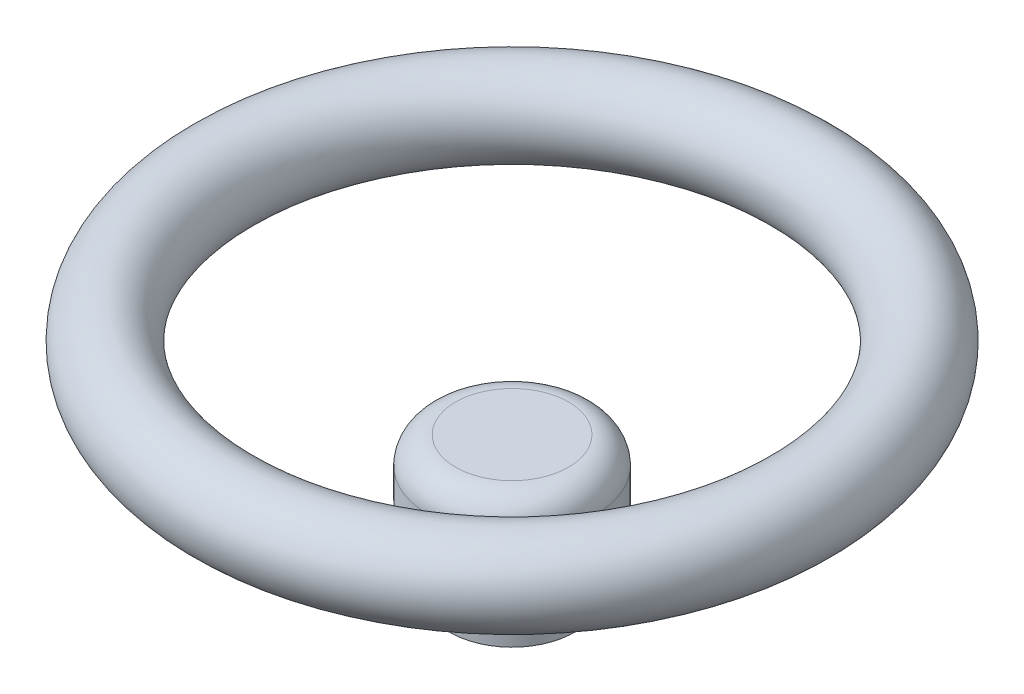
ISO-10303-21;
HEADER;
FILE_DESCRIPTION(('STEP AP214'),'2;1');
FILE_NAME('part.step','',(''),(''),'','','');
FILE_SCHEMA(('AUTOMOTIVE_DESIGN { 1 0 10303 214 1 1 1 1 }'));
ENDSEC;
DATA;
#1=APPLICATION_CONTEXT('core data for automotive mechanical design processes');
#2=APPLICATION_PROTOCOL_DEFINITION('international standard','automotive_design',2000,#1);
#3=PRODUCT_CONTEXT('',#1,'mechanical');
#4=PRODUCT('Part','Part','',(#3));
#5=PRODUCT_RELATED_PRODUCT_CATEGORY('part','',(#4));
#6=PRODUCT_DEFINITION_FORMATION('','',#4);
#7=PRODUCT_DEFINITION_CONTEXT('part definition',#1,'design');
#8=PRODUCT_DEFINITION('design','',#6,#7);
#9=PRODUCT_DEFINITION_SHAPE('','',#8);
#10=(LENGTH_UNIT() NAMED_UNIT(*) SI_UNIT(.MILLI.,.METRE.));
#11=(NAMED_UNIT(*) PLANE_ANGLE_UNIT() SI_UNIT($,.RADIAN.));
#12=(NAMED_UNIT(*) SI_UNIT($,.STERADIAN.) SOLID_ANGLE_UNIT());
#13=UNCERTAINTY_MEASURE_WITH_UNIT(LENGTH_MEASURE(1.E-05),#10,'distance_accuracy_value','');
#14=(GEOMETRIC_REPRESENTATION_CONTEXT(3) GLOBAL_UNCERTAINTY_ASSIGNED_CONTEXT((#13)) GLOBAL_UNIT_ASSIGNED_CONTEXT((#10,
#11,#12)) REPRESENTATION_CONTEXT('',''));
#15=CARTESIAN_POINT('',(0.,0.,0.));
#16=DIRECTION('',(0.,0.,1.));
#17=DIRECTION('',(1.,0.,0.));
#18=AXIS2_PLACEMENT_3D('',#15,#16,#17);
#19=CARTESIAN_POINT('',(0.,17.0750983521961,0.));
#20=DIRECTION('',(0.,1.,0.));
#21=DIRECTION('',(-1.,0.,0.));
#22=AXIS2_PLACEMENT_3D('',#19,#20,#21);
#23=TOROIDAL_SURFACE('',#22,60.4458481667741,8.73498068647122);
#24=CARTESIAN_POINT('',(-69.1808288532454,17.0750983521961,0.));
#25=VERTEX_POINT('',#24);
#26=VERTEX_LOOP('',#25);
#27=FACE_BOUND('',#26,.T.);
#28=ADVANCED_FACE('F36',(#27),#23,.T.);
#29=CLOSED_SHELL('',(#28));
#30=MANIFOLD_SOLID_BREP('B2',#29);
#31=CARTESIAN_POINT('',(0.,0.,0.));
#32=DIRECTION('',(0.,-1.,0.));
#33=DIRECTION('',(1.,0.,0.));
#34=AXIS2_PLACEMENT_3D('',#31,#32,#33);
#35=PLANE('',#34);
#36=CARTESIAN_POINT('',(0.,0.,0.));
#37=DIRECTION('',(0.,1.,0.));
#38=DIRECTION('',(-1.,0.,0.));
#39=AXIS2_PLACEMENT_3D('',#36,#37,#38);
#40=CIRCLE('',#39,11.8621252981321);
#41=CARTESIAN_POINT('',(-11.8621252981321,0.,0.));
#42=VERTEX_POINT('',#41);
#43=EDGE_CURVE('E35',#42,#42,#40,.T.);
#44=ORIENTED_EDGE('',*,*,#43,.T.);
#45=EDGE_LOOP('',(#44));
#46=FACE_BOUND('',#45,.T.);
#47=ADVANCED_FACE('F48',(#46),#35,.F.);
#48=CARTESIAN_POINT('',(0.,-5.72295049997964,0.));
#49=DIRECTION('',(0.,1.,0.));
#50=DIRECTION('',(-1.,0.,0.));
#51=AXIS2_PLACEMENT_3D('',#48,#49,#50);
#52=TOROIDAL_SURFACE('',#51,11.8621252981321,5.72295049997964);
#53=ORIENTED_EDGE('',*,*,#43,.F.);
#54=EDGE_LOOP('',(#53));
#55=FACE_BOUND('',#54,.T.);
#56=CARTESIAN_POINT('',(0.,-5.72295049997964,0.));
#57=DIRECTION('',(0.,1.,0.));
#58=DIRECTION('',(-1.,0.,0.));
#59=AXIS2_PLACEMENT_3D('',#56,#57,#58);
#60=CIRCLE('',#59,17.5850757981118);
#61=CARTESIAN_POINT('',(-17.5850757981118,-5.72295049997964,0.));
#62=VERTEX_POINT('',#61);
#63=EDGE_CURVE('E54',#62,#62,#60,.T.);
#64=ORIENTED_EDGE('',*,*,#63,.T.);
#65=EDGE_LOOP('',(#64));
#66=FACE_BOUND('',#65,.T.);
#67=ADVANCED_FACE('F83',(#55,#66),#52,.T.);
#68=CARTESIAN_POINT('',(0.,0.,0.));
#69=DIRECTION('',(0.,1.,0.));
#70=DIRECTION('',(-1.,0.,0.));
#71=AXIS2_PLACEMENT_3D('',#68,#69,#70);
#72=CYLINDRICAL_SURFACE('',#71,17.5850757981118);
#73=ORIENTED_EDGE('',*,*,#63,.F.);
#74=EDGE_LOOP('',(#73));
#75=FACE_BOUND('',#74,.T.);
#76=CARTESIAN_POINT('',(0.,-12.382969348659,0.));
#77=DIRECTION('',(0.,1.,0.));
#78=DIRECTION('',(-1.,0.,0.));
#79=AXIS2_PLACEMENT_3D('',#76,#77,#78);
#80=CIRCLE('',#79,17.5850757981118);
#81=CARTESIAN_POINT('',(-17.5850757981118,-12.382969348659,0.));
#82=VERTEX_POINT('',#81);
#83=EDGE_CURVE('E58',#82,#82,#80,.T.);
#84=ORIENTED_EDGE('',*,*,#83,.T.);
#85=EDGE_LOOP('',(#84));
#86=FACE_BOUND('',#85,.T.);
#87=ADVANCED_FACE('F87',(#75,#86),#72,.T.);
#88=CARTESIAN_POINT('',(17.5850757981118,-12.382969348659,0.));
#89=DIRECTION('',(0.,1.,0.));
#90=DIRECTION('',(-1.,0.,0.));
#91=AXIS2_PLACEMENT_3D('',#88,#89,#90);
#92=PLANE('',#91);
#93=ORIENTED_EDGE('',*,*,#83,.F.);
#94=EDGE_LOOP('',(#93));
#95=FACE_BOUND('',#94,.T.);
#96=CARTESIAN_POINT('',(0.,-12.382969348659,0.));
#97=DIRECTION('',(0.,1.,0.));
#98=DIRECTION('',(-1.,0.,0.));
#99=AXIS2_PLACEMENT_3D('',#96,#97,#98);
#100=CIRCLE('',#99,13.0620975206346);
#101=CARTESIAN_POINT('',(-13.0620975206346,-12.382969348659,0.));
#102=VERTEX_POINT('',#101);
#103=EDGE_CURVE('E62',#102,#102,#100,.T.);
#104=ORIENTED_EDGE('',*,*,#103,.T.);
#105=EDGE_LOOP('',(#104));
#106=FACE_BOUND('',#105,.T.);
#107=ADVANCED_FACE('F79',(#95,#106),#92,.F.);
#108=CARTESIAN_POINT('',(0.,0.,0.));
#109=DIRECTION('',(0.,1.,0.));
#110=DIRECTION('',(-1.,0.,0.));
#111=AXIS2_PLACEMENT_3D('',#108,#109,#110);
#112=CYLINDRICAL_SURFACE('',#111,13.0620975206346);
#113=ORIENTED_EDGE('',*,*,#103,.F.);
#114=EDGE_LOOP('',(#113));
#115=FACE_BOUND('',#114,.T.);
#116=CARTESIAN_POINT('',(0.,-29.4270498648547,0.));
#117=DIRECTION('',(0.,1.,0.));
#118=DIRECTION('',(-1.,0.,0.));
#119=AXIS2_PLACEMENT_3D('',#116,#117,#118);
#120=CIRCLE('',#119,13.0620975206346);
#121=CARTESIAN_POINT('',(-13.0620975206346,-29.4270498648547,0.));
#122=VERTEX_POINT('',#121);
#123=EDGE_CURVE('E67',#122,#122,#120,.T.);
#124=ORIENTED_EDGE('',*,*,#123,.T.);
#125=EDGE_LOOP('',(#124));
#126=FACE_BOUND('',#125,.T.);
#127=ADVANCED_FACE('F71',(#115,#126),#112,.T.);
#128=CARTESIAN_POINT('',(13.0620975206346,-29.4270498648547,0.));
#129=DIRECTION('',(0.,1.,0.));
#130=DIRECTION('',(-1.,0.,0.));
#131=AXIS2_PLACEMENT_3D('',#128,#129,#130);
#132=PLANE('',#131);
#133=ORIENTED_EDGE('',*,*,#123,.F.);
#134=EDGE_LOOP('',(#133));
#135=FACE_BOUND('',#134,.T.);
#136=ADVANCED_FACE('F73',(#135),#132,.F.);
#137=CLOSED_SHELL('',(#47,#67,#87,#107,#127,#136));
#138=MANIFOLD_SOLID_BREP('B6',#137);
#139=ADVANCED_BREP_SHAPE_REPRESENTATION('',(#18,#30,#138),#14);
#140=SHAPE_DEFINITION_REPRESENTATION(#9,#139);
ENDSEC;
END-ISO-10303-21;
